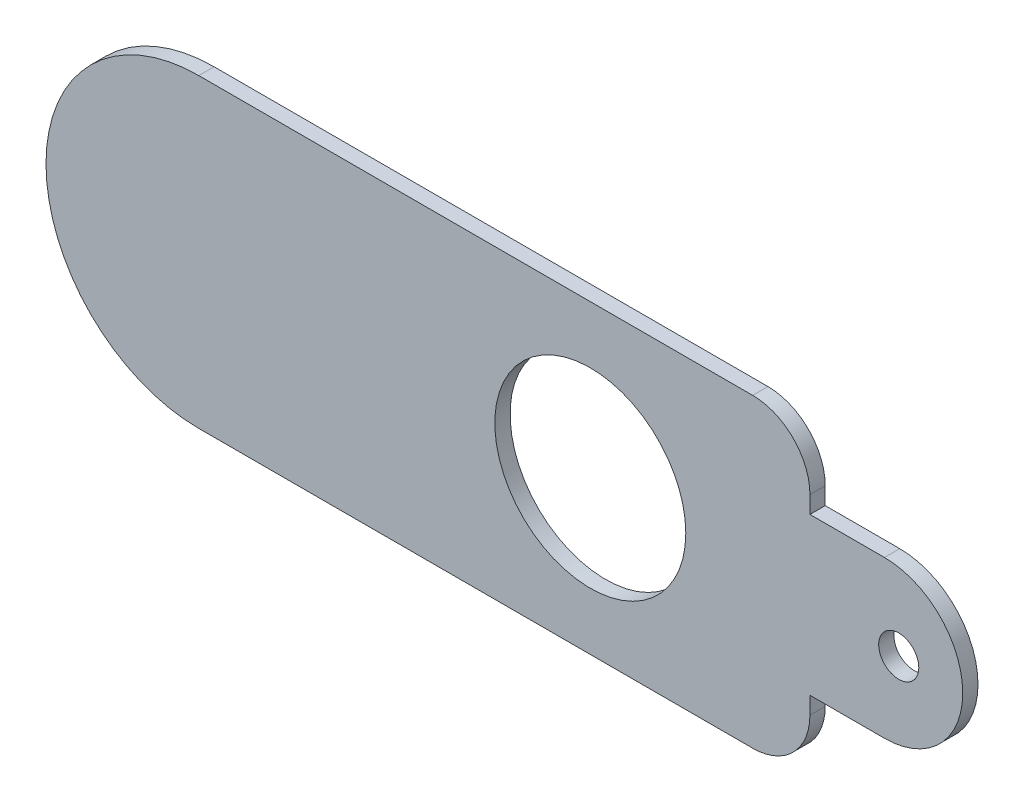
ISO-10303-21;
HEADER;
FILE_DESCRIPTION(('STEP AP214'),'2;1');
FILE_NAME('part.step','',(''),(''),'','','');
FILE_SCHEMA(('AUTOMOTIVE_DESIGN { 1 0 10303 214 1 1 1 1 }'));
ENDSEC;
DATA;
#1=APPLICATION_CONTEXT('core data for automotive mechanical design processes');
#2=APPLICATION_PROTOCOL_DEFINITION('international standard','automotive_design',2000,#1);
#3=PRODUCT_CONTEXT('',#1,'mechanical');
#4=PRODUCT('Part','Part','',(#3));
#5=PRODUCT_RELATED_PRODUCT_CATEGORY('part','',(#4));
#6=PRODUCT_DEFINITION_FORMATION('','',#4);
#7=PRODUCT_DEFINITION_CONTEXT('part definition',#1,'design');
#8=PRODUCT_DEFINITION('design','',#6,#7);
#9=PRODUCT_DEFINITION_SHAPE('','',#8);
#10=(LENGTH_UNIT() NAMED_UNIT(*) SI_UNIT(.MILLI.,.METRE.));
#11=(NAMED_UNIT(*) PLANE_ANGLE_UNIT() SI_UNIT($,.RADIAN.));
#12=(NAMED_UNIT(*) SI_UNIT($,.STERADIAN.) SOLID_ANGLE_UNIT());
#13=UNCERTAINTY_MEASURE_WITH_UNIT(LENGTH_MEASURE(1.E-05),#10,'distance_accuracy_value','');
#14=(GEOMETRIC_REPRESENTATION_CONTEXT(3) GLOBAL_UNCERTAINTY_ASSIGNED_CONTEXT((#13)) GLOBAL_UNIT_ASSIGNED_CONTEXT((#10,
#11,#12)) REPRESENTATION_CONTEXT('',''));
#15=CARTESIAN_POINT('',(0.,0.,0.));
#16=DIRECTION('',(0.,0.,1.));
#17=DIRECTION('',(1.,0.,0.));
#18=AXIS2_PLACEMENT_3D('',#15,#16,#17);
#19=CARTESIAN_POINT('',(-20.5,0.,0.8));
#20=DIRECTION('',(0.,0.,1.));
#21=DIRECTION('',(1.,0.,0.));
#22=AXIS2_PLACEMENT_3D('',#19,#20,#21);
#23=PLANE('',#22);
#24=CARTESIAN_POINT('',(0.,0.,0.8));
#25=DIRECTION('',(0.,0.,1.));
#26=DIRECTION('',(1.,0.,0.));
#27=AXIS2_PLACEMENT_3D('',#24,#25,#26);
#28=CIRCLE('',#27,5.);
#29=CARTESIAN_POINT('',(5.,0.,0.8));
#30=VERTEX_POINT('',#29);
#31=EDGE_CURVE('E147',#30,#30,#28,.T.);
#32=ORIENTED_EDGE('',*,*,#31,.F.);
#33=EDGE_LOOP('',(#32));
#34=FACE_BOUND('',#33,.T.);
#35=CARTESIAN_POINT('',(-20.5,0.,0.8));
#36=DIRECTION('',(0.,0.,1.));
#37=DIRECTION('',(1.,0.,0.));
#38=AXIS2_PLACEMENT_3D('',#35,#36,#37);
#39=CIRCLE('',#38,8.);
#40=CARTESIAN_POINT('',(-20.5,8.,0.8));
#41=VERTEX_POINT('',#40);
#42=CARTESIAN_POINT('',(-20.5,-8.,0.8));
#43=VERTEX_POINT('',#42);
#44=EDGE_CURVE('E162',#41,#43,#39,.T.);
#45=ORIENTED_EDGE('',*,*,#44,.T.);
#46=DIRECTION('',(1.,0.,0.));
#47=VECTOR('',#46,1.);
#48=CARTESIAN_POINT('',(-20.5,-8.,0.8));
#49=LINE('',#48,#47);
#50=CARTESIAN_POINT('',(8.49999999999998,-8.,0.8));
#51=VERTEX_POINT('',#50);
#52=EDGE_CURVE('E100',#43,#51,#49,.T.);
#53=ORIENTED_EDGE('',*,*,#52,.T.);
#54=CARTESIAN_POINT('',(8.5,-5.,0.8));
#55=DIRECTION('',(0.,0.,1.));
#56=DIRECTION('',(1.,0.,0.));
#57=AXIS2_PLACEMENT_3D('',#54,#55,#56);
#58=CIRCLE('',#57,3.);
#59=CARTESIAN_POINT('',(11.5,-4.99999999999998,0.8));
#60=VERTEX_POINT('',#59);
#61=EDGE_CURVE('E183',#51,#60,#58,.T.);
#62=ORIENTED_EDGE('',*,*,#61,.T.);
#63=DIRECTION('',(0.,1.,0.));
#64=VECTOR('',#63,1.);
#65=CARTESIAN_POINT('',(11.5,-4.99999999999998,0.8));
#66=LINE('',#65,#64);
#67=CARTESIAN_POINT('',(11.5,-4.1,0.8));
#68=VERTEX_POINT('',#67);
#69=EDGE_CURVE('E202',#60,#68,#66,.T.);
#70=ORIENTED_EDGE('',*,*,#69,.T.);
#71=DIRECTION('',(1.,0.,0.));
#72=VECTOR('',#71,1.);
#73=CARTESIAN_POINT('',(15.4,-4.1,0.8));
#74=LINE('',#73,#72);
#75=CARTESIAN_POINT('',(15.4,-4.1,0.8));
#76=VERTEX_POINT('',#75);
#77=EDGE_CURVE('E199',#68,#76,#74,.T.);
#78=ORIENTED_EDGE('',*,*,#77,.T.);
#79=CARTESIAN_POINT('',(15.4,0.,0.8));
#80=DIRECTION('',(0.,0.,1.));
#81=DIRECTION('',(-1.,0.,0.));
#82=AXIS2_PLACEMENT_3D('',#79,#80,#81);
#83=CIRCLE('',#82,4.1);
#84=CARTESIAN_POINT('',(15.4,4.1,0.8));
#85=VERTEX_POINT('',#84);
#86=EDGE_CURVE('E201',#76,#85,#83,.T.);
#87=ORIENTED_EDGE('',*,*,#86,.T.);
#88=DIRECTION('',(-1.,0.,0.));
#89=VECTOR('',#88,1.);
#90=CARTESIAN_POINT('',(11.5,4.1,0.8));
#91=LINE('',#90,#89);
#92=CARTESIAN_POINT('',(11.5,4.1,0.8));
#93=VERTEX_POINT('',#92);
#94=EDGE_CURVE('E125',#85,#93,#91,.T.);
#95=ORIENTED_EDGE('',*,*,#94,.T.);
#96=DIRECTION('',(0.,1.,0.));
#97=VECTOR('',#96,1.);
#98=CARTESIAN_POINT('',(11.5,4.99999999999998,0.8));
#99=LINE('',#98,#97);
#100=CARTESIAN_POINT('',(11.5,4.99999999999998,0.8));
#101=VERTEX_POINT('',#100);
#102=EDGE_CURVE('E119',#93,#101,#99,.T.);
#103=ORIENTED_EDGE('',*,*,#102,.T.);
#104=CARTESIAN_POINT('',(8.5,5.,0.8));
#105=DIRECTION('',(0.,0.,1.));
#106=DIRECTION('',(-1.,0.,0.));
#107=AXIS2_PLACEMENT_3D('',#104,#105,#106);
#108=CIRCLE('',#107,3.);
#109=CARTESIAN_POINT('',(8.49999999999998,8.,0.8));
#110=VERTEX_POINT('',#109);
#111=EDGE_CURVE('E123',#101,#110,#108,.T.);
#112=ORIENTED_EDGE('',*,*,#111,.T.);
#113=DIRECTION('',(-1.,0.,0.));
#114=VECTOR('',#113,1.);
#115=CARTESIAN_POINT('',(-20.5,8.,0.8));
#116=LINE('',#115,#114);
#117=EDGE_CURVE('E51',#110,#41,#116,.T.);
#118=ORIENTED_EDGE('',*,*,#117,.T.);
#119=EDGE_LOOP('',(#45,#53,#62,#70,#78,#87,#95,#103,#112,#118));
#120=FACE_BOUND('',#119,.T.);
#121=CARTESIAN_POINT('',(16.15,0.,0.8));
#122=DIRECTION('',(0.,0.,1.));
#123=DIRECTION('',(1.,0.,0.));
#124=AXIS2_PLACEMENT_3D('',#121,#122,#123);
#125=CIRCLE('',#124,1.05);
#126=CARTESIAN_POINT('',(17.2,0.,0.8));
#127=VERTEX_POINT('',#126);
#128=EDGE_CURVE('E213',#127,#127,#125,.T.);
#129=ORIENTED_EDGE('',*,*,#128,.F.);
#130=EDGE_LOOP('',(#129));
#131=FACE_BOUND('',#130,.T.);
#132=ADVANCED_FACE('F34',(#34,#120,#131),#23,.T.);
#133=CARTESIAN_POINT('',(-20.5,0.,0.));
#134=DIRECTION('',(0.,0.,1.));
#135=DIRECTION('',(1.,0.,0.));
#136=AXIS2_PLACEMENT_3D('',#133,#134,#135);
#137=PLANE('',#136);
#138=CARTESIAN_POINT('',(0.,0.,0.));
#139=DIRECTION('',(0.,0.,1.));
#140=DIRECTION('',(1.,0.,0.));
#141=AXIS2_PLACEMENT_3D('',#138,#139,#140);
#142=CIRCLE('',#141,5.);
#143=CARTESIAN_POINT('',(5.,0.,0.));
#144=VERTEX_POINT('',#143);
#145=EDGE_CURVE('E210',#144,#144,#142,.T.);
#146=ORIENTED_EDGE('',*,*,#145,.T.);
#147=EDGE_LOOP('',(#146));
#148=FACE_BOUND('',#147,.T.);
#149=CARTESIAN_POINT('',(-20.5,0.,0.));
#150=DIRECTION('',(0.,0.,1.));
#151=DIRECTION('',(1.,0.,0.));
#152=AXIS2_PLACEMENT_3D('',#149,#150,#151);
#153=CIRCLE('',#152,8.);
#154=CARTESIAN_POINT('',(-20.5,8.,0.));
#155=VERTEX_POINT('',#154);
#156=CARTESIAN_POINT('',(-20.5,-8.,0.));
#157=VERTEX_POINT('',#156);
#158=EDGE_CURVE('E143',#155,#157,#153,.T.);
#159=ORIENTED_EDGE('',*,*,#158,.F.);
#160=DIRECTION('',(-1.,0.,0.));
#161=VECTOR('',#160,1.);
#162=CARTESIAN_POINT('',(-20.5,8.,0.));
#163=LINE('',#162,#161);
#164=CARTESIAN_POINT('',(8.49999999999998,8.,0.));
#165=VERTEX_POINT('',#164);
#166=EDGE_CURVE('E92',#165,#155,#163,.T.);
#167=ORIENTED_EDGE('',*,*,#166,.F.);
#168=CARTESIAN_POINT('',(8.5,5.,0.));
#169=DIRECTION('',(0.,0.,1.));
#170=DIRECTION('',(-1.,0.,0.));
#171=AXIS2_PLACEMENT_3D('',#168,#169,#170);
#172=CIRCLE('',#171,3.);
#173=CARTESIAN_POINT('',(11.5,4.99999999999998,0.));
#174=VERTEX_POINT('',#173);
#175=EDGE_CURVE('E86',#174,#165,#172,.T.);
#176=ORIENTED_EDGE('',*,*,#175,.F.);
#177=DIRECTION('',(0.,1.,0.));
#178=VECTOR('',#177,1.);
#179=CARTESIAN_POINT('',(11.5,4.99999999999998,0.));
#180=LINE('',#179,#178);
#181=CARTESIAN_POINT('',(11.5,4.1,0.));
#182=VERTEX_POINT('',#181);
#183=EDGE_CURVE('E133',#182,#174,#180,.T.);
#184=ORIENTED_EDGE('',*,*,#183,.F.);
#185=DIRECTION('',(-1.,0.,0.));
#186=VECTOR('',#185,1.);
#187=CARTESIAN_POINT('',(11.5,4.1,0.));
#188=LINE('',#187,#186);
#189=CARTESIAN_POINT('',(15.4,4.1,0.));
#190=VERTEX_POINT('',#189);
#191=EDGE_CURVE('E157',#190,#182,#188,.T.);
#192=ORIENTED_EDGE('',*,*,#191,.F.);
#193=CARTESIAN_POINT('',(15.4,0.,0.));
#194=DIRECTION('',(0.,0.,1.));
#195=DIRECTION('',(-1.,0.,0.));
#196=AXIS2_PLACEMENT_3D('',#193,#194,#195);
#197=CIRCLE('',#196,4.1);
#198=CARTESIAN_POINT('',(15.4,-4.1,0.));
#199=VERTEX_POINT('',#198);
#200=EDGE_CURVE('E155',#199,#190,#197,.T.);
#201=ORIENTED_EDGE('',*,*,#200,.F.);
#202=DIRECTION('',(1.,0.,0.));
#203=VECTOR('',#202,1.);
#204=CARTESIAN_POINT('',(15.4,-4.1,0.));
#205=LINE('',#204,#203);
#206=CARTESIAN_POINT('',(11.5,-4.1,0.));
#207=VERTEX_POINT('',#206);
#208=EDGE_CURVE('E153',#207,#199,#205,.T.);
#209=ORIENTED_EDGE('',*,*,#208,.F.);
#210=DIRECTION('',(0.,1.,0.));
#211=VECTOR('',#210,1.);
#212=CARTESIAN_POINT('',(11.5,-4.99999999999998,0.));
#213=LINE('',#212,#211);
#214=CARTESIAN_POINT('',(11.5,-4.99999999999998,0.));
#215=VERTEX_POINT('',#214);
#216=EDGE_CURVE('E151',#215,#207,#213,.T.);
#217=ORIENTED_EDGE('',*,*,#216,.F.);
#218=CARTESIAN_POINT('',(8.5,-5.,0.));
#219=DIRECTION('',(0.,0.,1.));
#220=DIRECTION('',(1.,0.,0.));
#221=AXIS2_PLACEMENT_3D('',#218,#219,#220);
#222=CIRCLE('',#221,3.);
#223=CARTESIAN_POINT('',(8.49999999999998,-8.,0.));
#224=VERTEX_POINT('',#223);
#225=EDGE_CURVE('E149',#224,#215,#222,.T.);
#226=ORIENTED_EDGE('',*,*,#225,.F.);
#227=DIRECTION('',(1.,0.,0.));
#228=VECTOR('',#227,1.);
#229=CARTESIAN_POINT('',(-20.5,-8.,0.));
#230=LINE('',#229,#228);
#231=EDGE_CURVE('E146',#157,#224,#230,.T.);
#232=ORIENTED_EDGE('',*,*,#231,.F.);
#233=EDGE_LOOP('',(#159,#167,#176,#184,#192,#201,#209,#217,#226,#232));
#234=FACE_BOUND('',#233,.T.);
#235=CARTESIAN_POINT('',(16.15,0.,0.));
#236=DIRECTION('',(0.,0.,1.));
#237=DIRECTION('',(1.,0.,0.));
#238=AXIS2_PLACEMENT_3D('',#235,#236,#237);
#239=CIRCLE('',#238,1.05);
#240=CARTESIAN_POINT('',(17.2,0.,0.));
#241=VERTEX_POINT('',#240);
#242=EDGE_CURVE('E216',#241,#241,#239,.T.);
#243=ORIENTED_EDGE('',*,*,#242,.T.);
#244=EDGE_LOOP('',(#243));
#245=FACE_BOUND('',#244,.T.);
#246=ADVANCED_FACE('F187',(#148,#234,#245),#137,.F.);
#247=CARTESIAN_POINT('',(-20.5,0.,0.8));
#248=DIRECTION('',(0.,0.,-1.));
#249=DIRECTION('',(-1.,0.,0.));
#250=AXIS2_PLACEMENT_3D('',#247,#248,#249);
#251=CYLINDRICAL_SURFACE('',#250,8.);
#252=ORIENTED_EDGE('',*,*,#158,.T.);
#253=DIRECTION('',(0.,0.,-1.));
#254=VECTOR('',#253,1.);
#255=CARTESIAN_POINT('',(-20.5,-8.,0.8));
#256=LINE('',#255,#254);
#257=EDGE_CURVE('E11',#43,#157,#256,.T.);
#258=ORIENTED_EDGE('',*,*,#257,.F.);
#259=ORIENTED_EDGE('',*,*,#44,.F.);
#260=DIRECTION('',(0.,0.,-1.));
#261=VECTOR('',#260,1.);
#262=CARTESIAN_POINT('',(-20.5,8.,0.8));
#263=LINE('',#262,#261);
#264=EDGE_CURVE('E139',#41,#155,#263,.T.);
#265=ORIENTED_EDGE('',*,*,#264,.T.);
#266=EDGE_LOOP('',(#252,#258,#259,#265));
#267=FACE_BOUND('',#266,.T.);
#268=ADVANCED_FACE('F36',(#267),#251,.T.);
#269=CARTESIAN_POINT('',(-20.5,-8.,0.8));
#270=DIRECTION('',(0.,1.,0.));
#271=DIRECTION('',(0.,0.,1.));
#272=AXIS2_PLACEMENT_3D('',#269,#270,#271);
#273=PLANE('',#272);
#274=ORIENTED_EDGE('',*,*,#231,.T.);
#275=DIRECTION('',(0.,0.,-1.));
#276=VECTOR('',#275,1.);
#277=CARTESIAN_POINT('',(8.49999999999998,-8.,0.8));
#278=LINE('',#277,#276);
#279=EDGE_CURVE('E43',#51,#224,#278,.T.);
#280=ORIENTED_EDGE('',*,*,#279,.F.);
#281=ORIENTED_EDGE('',*,*,#52,.F.);
#282=ORIENTED_EDGE('',*,*,#257,.T.);
#283=EDGE_LOOP('',(#274,#280,#281,#282));
#284=FACE_BOUND('',#283,.T.);
#285=ADVANCED_FACE('F257',(#284),#273,.F.);
#286=CARTESIAN_POINT('',(8.5,-5.,0.8));
#287=DIRECTION('',(0.,0.,-1.));
#288=DIRECTION('',(-1.,0.,0.));
#289=AXIS2_PLACEMENT_3D('',#286,#287,#288);
#290=CYLINDRICAL_SURFACE('',#289,3.);
#291=ORIENTED_EDGE('',*,*,#225,.T.);
#292=DIRECTION('',(0.,0.,-1.));
#293=VECTOR('',#292,1.);
#294=CARTESIAN_POINT('',(11.5,-4.99999999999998,0.8));
#295=LINE('',#294,#293);
#296=EDGE_CURVE('E175',#60,#215,#295,.T.);
#297=ORIENTED_EDGE('',*,*,#296,.F.);
#298=ORIENTED_EDGE('',*,*,#61,.F.);
#299=ORIENTED_EDGE('',*,*,#279,.T.);
#300=EDGE_LOOP('',(#291,#297,#298,#299));
#301=FACE_BOUND('',#300,.T.);
#302=ADVANCED_FACE('F181',(#301),#290,.T.);
#303=CARTESIAN_POINT('',(11.5,-4.99999999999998,0.8));
#304=DIRECTION('',(-1.,0.,0.));
#305=DIRECTION('',(0.,0.,1.));
#306=AXIS2_PLACEMENT_3D('',#303,#304,#305);
#307=PLANE('',#306);
#308=ORIENTED_EDGE('',*,*,#216,.T.);
#309=DIRECTION('',(0.,0.,-1.));
#310=VECTOR('',#309,1.);
#311=CARTESIAN_POINT('',(11.5,-4.1,0.8));
#312=LINE('',#311,#310);
#313=EDGE_CURVE('E172',#68,#207,#312,.T.);
#314=ORIENTED_EDGE('',*,*,#313,.F.);
#315=ORIENTED_EDGE('',*,*,#69,.F.);
#316=ORIENTED_EDGE('',*,*,#296,.T.);
#317=EDGE_LOOP('',(#308,#314,#315,#316));
#318=FACE_BOUND('',#317,.T.);
#319=ADVANCED_FACE('F193',(#318),#307,.F.);
#320=CARTESIAN_POINT('',(15.4,-4.1,0.8));
#321=DIRECTION('',(0.,1.,0.));
#322=DIRECTION('',(-1.,0.,0.));
#323=AXIS2_PLACEMENT_3D('',#320,#321,#322);
#324=PLANE('',#323);
#325=ORIENTED_EDGE('',*,*,#208,.T.);
#326=DIRECTION('',(0.,0.,-1.));
#327=VECTOR('',#326,1.);
#328=CARTESIAN_POINT('',(15.4,-4.1,0.8));
#329=LINE('',#328,#327);
#330=EDGE_CURVE('E169',#76,#199,#329,.T.);
#331=ORIENTED_EDGE('',*,*,#330,.F.);
#332=ORIENTED_EDGE('',*,*,#77,.F.);
#333=ORIENTED_EDGE('',*,*,#313,.T.);
#334=EDGE_LOOP('',(#325,#331,#332,#333));
#335=FACE_BOUND('',#334,.T.);
#336=ADVANCED_FACE('F197',(#335),#324,.F.);
#337=CARTESIAN_POINT('',(15.4,0.,0.8));
#338=DIRECTION('',(0.,0.,-1.));
#339=DIRECTION('',(-1.,0.,0.));
#340=AXIS2_PLACEMENT_3D('',#337,#338,#339);
#341=CYLINDRICAL_SURFACE('',#340,4.1);
#342=ORIENTED_EDGE('',*,*,#200,.T.);
#343=DIRECTION('',(0.,0.,-1.));
#344=VECTOR('',#343,1.);
#345=CARTESIAN_POINT('',(15.4,4.1,0.8));
#346=LINE('',#345,#344);
#347=EDGE_CURVE('E166',#85,#190,#346,.T.);
#348=ORIENTED_EDGE('',*,*,#347,.F.);
#349=ORIENTED_EDGE('',*,*,#86,.F.);
#350=ORIENTED_EDGE('',*,*,#330,.T.);
#351=EDGE_LOOP('',(#342,#348,#349,#350));
#352=FACE_BOUND('',#351,.T.);
#353=ADVANCED_FACE('F247',(#352),#341,.T.);
#354=CARTESIAN_POINT('',(11.5,4.1,0.8));
#355=DIRECTION('',(0.,-1.,0.));
#356=DIRECTION('',(1.,0.,0.));
#357=AXIS2_PLACEMENT_3D('',#354,#355,#356);
#358=PLANE('',#357);
#359=ORIENTED_EDGE('',*,*,#191,.T.);
#360=DIRECTION('',(0.,0.,-1.));
#361=VECTOR('',#360,1.);
#362=CARTESIAN_POINT('',(11.5,4.1,0.8));
#363=LINE('',#362,#361);
#364=EDGE_CURVE('E134',#93,#182,#363,.T.);
#365=ORIENTED_EDGE('',*,*,#364,.F.);
#366=ORIENTED_EDGE('',*,*,#94,.F.);
#367=ORIENTED_EDGE('',*,*,#347,.T.);
#368=EDGE_LOOP('',(#359,#365,#366,#367));
#369=FACE_BOUND('',#368,.T.);
#370=ADVANCED_FACE('F244',(#369),#358,.F.);
#371=CARTESIAN_POINT('',(11.5,4.99999999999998,0.8));
#372=DIRECTION('',(-1.,0.,0.));
#373=DIRECTION('',(0.,0.,1.));
#374=AXIS2_PLACEMENT_3D('',#371,#372,#373);
#375=PLANE('',#374);
#376=ORIENTED_EDGE('',*,*,#183,.T.);
#377=DIRECTION('',(0.,0.,-1.));
#378=VECTOR('',#377,1.);
#379=CARTESIAN_POINT('',(11.5,4.99999999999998,0.8));
#380=LINE('',#379,#378);
#381=EDGE_CURVE('E130',#101,#174,#380,.T.);
#382=ORIENTED_EDGE('',*,*,#381,.F.);
#383=ORIENTED_EDGE('',*,*,#102,.F.);
#384=ORIENTED_EDGE('',*,*,#364,.T.);
#385=EDGE_LOOP('',(#376,#382,#383,#384));
#386=FACE_BOUND('',#385,.T.);
#387=ADVANCED_FACE('F131',(#386),#375,.F.);
#388=CARTESIAN_POINT('',(8.5,5.,0.8));
#389=DIRECTION('',(0.,0.,-1.));
#390=DIRECTION('',(-1.,0.,0.));
#391=AXIS2_PLACEMENT_3D('',#388,#389,#390);
#392=CYLINDRICAL_SURFACE('',#391,3.);
#393=ORIENTED_EDGE('',*,*,#175,.T.);
#394=DIRECTION('',(0.,0.,-1.));
#395=VECTOR('',#394,1.);
#396=CARTESIAN_POINT('',(8.49999999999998,8.,0.8));
#397=LINE('',#396,#395);
#398=EDGE_CURVE('E135',#110,#165,#397,.T.);
#399=ORIENTED_EDGE('',*,*,#398,.F.);
#400=ORIENTED_EDGE('',*,*,#111,.F.);
#401=ORIENTED_EDGE('',*,*,#381,.T.);
#402=EDGE_LOOP('',(#393,#399,#400,#401));
#403=FACE_BOUND('',#402,.T.);
#404=ADVANCED_FACE('F137',(#403),#392,.T.);
#405=CARTESIAN_POINT('',(-20.5,8.,0.8));
#406=DIRECTION('',(0.,-1.,0.));
#407=DIRECTION('',(0.,0.,-1.));
#408=AXIS2_PLACEMENT_3D('',#405,#406,#407);
#409=PLANE('',#408);
#410=ORIENTED_EDGE('',*,*,#166,.T.);
#411=ORIENTED_EDGE('',*,*,#264,.F.);
#412=ORIENTED_EDGE('',*,*,#117,.F.);
#413=ORIENTED_EDGE('',*,*,#398,.T.);
#414=EDGE_LOOP('',(#410,#411,#412,#413));
#415=FACE_BOUND('',#414,.T.);
#416=ADVANCED_FACE('F237',(#415),#409,.F.);
#417=CARTESIAN_POINT('',(0.,0.,0.8));
#418=DIRECTION('',(0.,0.,-1.));
#419=DIRECTION('',(-1.,0.,0.));
#420=AXIS2_PLACEMENT_3D('',#417,#418,#419);
#421=CYLINDRICAL_SURFACE('',#420,5.);
#422=ORIENTED_EDGE('',*,*,#31,.T.);
#423=EDGE_LOOP('',(#422));
#424=FACE_BOUND('',#423,.T.);
#425=ORIENTED_EDGE('',*,*,#145,.F.);
#426=EDGE_LOOP('',(#425));
#427=FACE_BOUND('',#426,.T.);
#428=ADVANCED_FACE('F234',(#424,#427),#421,.F.);
#429=CARTESIAN_POINT('',(16.15,0.,0.8));
#430=DIRECTION('',(0.,0.,-1.));
#431=DIRECTION('',(-1.,0.,0.));
#432=AXIS2_PLACEMENT_3D('',#429,#430,#431);
#433=CYLINDRICAL_SURFACE('',#432,1.05);
#434=ORIENTED_EDGE('',*,*,#128,.T.);
#435=EDGE_LOOP('',(#434));
#436=FACE_BOUND('',#435,.T.);
#437=ORIENTED_EDGE('',*,*,#242,.F.);
#438=EDGE_LOOP('',(#437));
#439=FACE_BOUND('',#438,.T.);
#440=ADVANCED_FACE('F222',(#436,#439),#433,.F.);
#441=CLOSED_SHELL('',(#132,#246,#268,#285,#302,#319,#336,#353,#370,#387,#404,#416,#428,#440));
#442=MANIFOLD_SOLID_BREP('B2',#441);
#443=ADVANCED_BREP_SHAPE_REPRESENTATION('',(#18,#442),#14);
#444=SHAPE_DEFINITION_REPRESENTATION(#9,#443);
ENDSEC;
END-ISO-10303-21;
